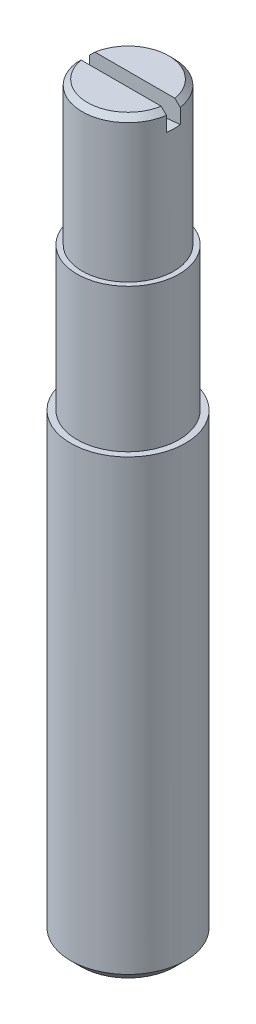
ISO-10303-21;
HEADER;
FILE_DESCRIPTION(('STEP AP214'),'2;1');
FILE_NAME('part.step','',(''),(''),'','','');
FILE_SCHEMA(('AUTOMOTIVE_DESIGN { 1 0 10303 214 1 1 1 1 }'));
ENDSEC;
DATA;
#1=APPLICATION_CONTEXT('core data for automotive mechanical design processes');
#2=APPLICATION_PROTOCOL_DEFINITION('international standard','automotive_design',2000,#1);
#3=PRODUCT_CONTEXT('',#1,'mechanical');
#4=PRODUCT('Part','Part','',(#3));
#5=PRODUCT_RELATED_PRODUCT_CATEGORY('part','',(#4));
#6=PRODUCT_DEFINITION_FORMATION('','',#4);
#7=PRODUCT_DEFINITION_CONTEXT('part definition',#1,'design');
#8=PRODUCT_DEFINITION('design','',#6,#7);
#9=PRODUCT_DEFINITION_SHAPE('','',#8);
#10=(LENGTH_UNIT() NAMED_UNIT(*) SI_UNIT(.MILLI.,.METRE.));
#11=(NAMED_UNIT(*) PLANE_ANGLE_UNIT() SI_UNIT($,.RADIAN.));
#12=(NAMED_UNIT(*) SI_UNIT($,.STERADIAN.) SOLID_ANGLE_UNIT());
#13=UNCERTAINTY_MEASURE_WITH_UNIT(LENGTH_MEASURE(1.E-05),#10,'distance_accuracy_value','');
#14=(GEOMETRIC_REPRESENTATION_CONTEXT(3) GLOBAL_UNCERTAINTY_ASSIGNED_CONTEXT((#13)) GLOBAL_UNIT_ASSIGNED_CONTEXT((#10,
#11,#12)) REPRESENTATION_CONTEXT('',''));
#15=CARTESIAN_POINT('',(0.,0.,0.));
#16=DIRECTION('',(0.,0.,1.));
#17=DIRECTION('',(1.,0.,0.));
#18=AXIS2_PLACEMENT_3D('',#15,#16,#17);
#19=CARTESIAN_POINT('',(0.,50.,0.));
#20=DIRECTION('',(0.,-1.,0.));
#21=DIRECTION('',(0.,0.,-1.));
#22=AXIS2_PLACEMENT_3D('',#19,#20,#21);
#23=PLANE('',#22);
#24=CARTESIAN_POINT('',(0.,50.0000000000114,0.));
#25=DIRECTION('',(0.,-1.,0.));
#26=DIRECTION('',(0.,0.,-1.));
#27=AXIS2_PLACEMENT_3D('',#24,#25,#26);
#28=CIRCLE('',#27,3.53999999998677);
#29=CARTESIAN_POINT('',(-3.48878202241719,50.0000000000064,-0.6));
#30=VERTEX_POINT('',#29);
#31=CARTESIAN_POINT('',(3.48878202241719,50.0000000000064,-0.6));
#32=VERTEX_POINT('',#31);
#33=EDGE_CURVE('E165',#30,#32,#28,.T.);
#34=ORIENTED_EDGE('',*,*,#33,.F.);
#35=DIRECTION('',(1.,0.,0.));
#36=VECTOR('',#35,1.);
#37=CARTESIAN_POINT('',(0.,50.,-0.6));
#38=LINE('',#37,#36);
#39=EDGE_CURVE('E163',#32,#30,#38,.F.);
#40=ORIENTED_EDGE('',*,*,#39,.F.);
#41=EDGE_LOOP('',(#34,#40));
#42=FACE_BOUND('',#41,.T.);
#43=ADVANCED_FACE('F14',(#42),#23,.F.);
#44=CARTESIAN_POINT('',(0.,50.,0.));
#45=DIRECTION('',(0.,-1.,0.));
#46=DIRECTION('',(0.,0.,-1.));
#47=AXIS2_PLACEMENT_3D('',#44,#45,#46);
#48=PLANE('',#47);
#49=DIRECTION('',(1.,0.,0.));
#50=VECTOR('',#49,1.);
#51=CARTESIAN_POINT('',(0.,50.,0.6));
#52=LINE('',#51,#50);
#53=CARTESIAN_POINT('',(-3.48878202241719,50.0000000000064,0.6));
#54=VERTEX_POINT('',#53);
#55=CARTESIAN_POINT('',(3.48878202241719,50.0000000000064,0.6));
#56=VERTEX_POINT('',#55);
#57=EDGE_CURVE('E161',#54,#56,#52,.T.);
#58=ORIENTED_EDGE('',*,*,#57,.F.);
#59=CARTESIAN_POINT('',(0.,50.0000000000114,0.));
#60=DIRECTION('',(0.,-1.,0.));
#61=DIRECTION('',(0.,0.,-1.));
#62=AXIS2_PLACEMENT_3D('',#59,#60,#61);
#63=CIRCLE('',#62,3.53999999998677);
#64=EDGE_CURVE('E159',#56,#54,#63,.T.);
#65=ORIENTED_EDGE('',*,*,#64,.F.);
#66=EDGE_LOOP('',(#58,#65));
#67=FACE_BOUND('',#66,.T.);
#68=ADVANCED_FACE('F121',(#67),#48,.F.);
#69=CARTESIAN_POINT('',(0.,49.5399999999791,0.));
#70=DIRECTION('',(0.,-1.,0.));
#71=DIRECTION('',(0.,0.,-1.));
#72=AXIS2_PLACEMENT_3D('',#69,#70,#71);
#73=CONICAL_SURFACE('',#72,3.99999999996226,0.785398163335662);
#74=CARTESIAN_POINT('',(-3.48878202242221,50.0000000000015,-0.6));
#75=CARTESIAN_POINT('',(-3.56650335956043,49.9233951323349,-0.6));
#76=CARTESIAN_POINT('',(-3.64419419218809,49.8467593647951,-0.6));
#77=CARTESIAN_POINT('',(-3.79951484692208,49.6934260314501,-0.6));
#78=CARTESIAN_POINT('',(-3.87714466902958,49.6167284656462,-0.6));
#79=CARTESIAN_POINT('',(-3.9547439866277,49.5399999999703,-0.6));
#80=B_SPLINE_CURVE_WITH_KNOTS('',3,(#74,#75,#76,#77,#78,#79),.UNSPECIFIED.,.F.,.F.,(4,2,4),(0.,
0.327383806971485,0.654767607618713),.UNSPECIFIED.);
#81=CARTESIAN_POINT('',(-3.95474398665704,49.5399999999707,-0.6));
#82=VERTEX_POINT('',#81);
#83=EDGE_CURVE('E39',#30,#82,#80,.T.);
#84=ORIENTED_EDGE('',*,*,#83,.F.);
#85=ORIENTED_EDGE('',*,*,#33,.T.);
#86=CARTESIAN_POINT('',(3.95474398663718,49.5399999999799,-0.600000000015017));
#87=CARTESIAN_POINT('',(3.87714466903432,49.616728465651,-0.600000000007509));
#88=CARTESIAN_POINT('',(3.79951484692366,49.6934260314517,-0.600000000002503));
#89=CARTESIAN_POINT('',(3.64419419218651,49.8467593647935,-0.599999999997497));
#90=CARTESIAN_POINT('',(3.56650335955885,49.9233951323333,-0.599999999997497));
#91=CARTESIAN_POINT('',(3.48878202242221,50.0000000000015,-0.6));
#92=B_SPLINE_CURVE_WITH_KNOTS('',3,(#86,#87,#88,#89,#90,#91),.UNSPECIFIED.,.F.,.F.,(4,2,4),(0.,
0.327383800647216,0.654767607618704),.UNSPECIFIED.);
#93=CARTESIAN_POINT('',(3.95474398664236,49.5399999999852,-0.6));
#94=VERTEX_POINT('',#93);
#95=EDGE_CURVE('E134',#94,#32,#92,.T.);
#96=ORIENTED_EDGE('',*,*,#95,.F.);
#97=CARTESIAN_POINT('',(0.,49.54,0.));
#98=DIRECTION('',(0.,-1.,0.));
#99=DIRECTION('',(0.,0.,-1.));
#100=AXIS2_PLACEMENT_3D('',#97,#98,#99);
#101=CIRCLE('',#100,4.);
#102=EDGE_CURVE('E175',#82,#94,#101,.T.);
#103=ORIENTED_EDGE('',*,*,#102,.F.);
#104=EDGE_LOOP('',(#84,#85,#96,#103));
#105=FACE_BOUND('',#104,.T.);
#106=ADVANCED_FACE('F116',(#105),#73,.T.);
#107=CARTESIAN_POINT('',(0.,79.5,-0.6));
#108=DIRECTION('',(0.,0.,1.));
#109=DIRECTION('',(1.,0.,0.));
#110=AXIS2_PLACEMENT_3D('',#107,#108,#109);
#111=PLANE('',#110);
#112=ORIENTED_EDGE('',*,*,#39,.T.);
#113=ORIENTED_EDGE('',*,*,#83,.T.);
#114=DIRECTION('',(0.,1.,0.));
#115=VECTOR('',#114,1.);
#116=CARTESIAN_POINT('',(-3.95474398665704,79.5,-0.6));
#117=LINE('',#116,#115);
#118=CARTESIAN_POINT('',(-3.95474398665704,48.2492400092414,-0.6));
#119=VERTEX_POINT('',#118);
#120=EDGE_CURVE('E154',#82,#119,#117,.F.);
#121=ORIENTED_EDGE('',*,*,#120,.T.);
#122=CARTESIAN_POINT('',(0.,79.5,-0.6));
#123=DIRECTION('',(0.,0.,-1.));
#124=DIRECTION('',(-1.,0.,0.));
#125=AXIS2_PLACEMENT_3D('',#122,#123,#124);
#126=CIRCLE('',#125,31.5);
#127=CARTESIAN_POINT('',(3.95474398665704,48.2492400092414,-0.6));
#128=VERTEX_POINT('',#127);
#129=EDGE_CURVE('E89',#119,#128,#126,.F.);
#130=ORIENTED_EDGE('',*,*,#129,.T.);
#131=DIRECTION('',(0.,1.,0.));
#132=VECTOR('',#131,1.);
#133=CARTESIAN_POINT('',(3.95474398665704,79.5,-0.6));
#134=LINE('',#133,#132);
#135=EDGE_CURVE('E140',#128,#94,#134,.T.);
#136=ORIENTED_EDGE('',*,*,#135,.T.);
#137=ORIENTED_EDGE('',*,*,#95,.T.);
#138=EDGE_LOOP('',(#112,#113,#121,#130,#136,#137));
#139=FACE_BOUND('',#138,.T.);
#140=ADVANCED_FACE('F120',(#139),#111,.T.);
#141=CARTESIAN_POINT('',(0.,49.5399999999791,0.));
#142=DIRECTION('',(0.,-1.,0.));
#143=DIRECTION('',(0.,0.,-1.));
#144=AXIS2_PLACEMENT_3D('',#141,#142,#143);
#145=CONICAL_SURFACE('',#144,3.99999999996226,0.785398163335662);
#146=ORIENTED_EDGE('',*,*,#64,.T.);
#147=CARTESIAN_POINT('',(-3.48878202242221,50.0000000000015,0.6));
#148=CARTESIAN_POINT('',(-3.56650335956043,49.9233951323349,0.6));
#149=CARTESIAN_POINT('',(-3.64419419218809,49.8467593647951,0.6));
#150=CARTESIAN_POINT('',(-3.79951484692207,49.6934260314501,0.6));
#151=CARTESIAN_POINT('',(-3.87714466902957,49.6167284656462,0.6));
#152=CARTESIAN_POINT('',(-3.95474398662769,49.5399999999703,0.6));
#153=B_SPLINE_CURVE_WITH_KNOTS('',3,(#147,#148,#149,#150,#151,#152),.UNSPECIFIED.,.F.,.F.,(4,2,
4),(0.,0.327383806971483,0.654767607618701),.UNSPECIFIED.);
#154=CARTESIAN_POINT('',(-3.95474398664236,49.5399999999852,0.6));
#155=VERTEX_POINT('',#154);
#156=EDGE_CURVE('E149',#54,#155,#153,.T.);
#157=ORIENTED_EDGE('',*,*,#156,.T.);
#158=CARTESIAN_POINT('',(0.,49.54,0.));
#159=DIRECTION('',(0.,-1.,0.));
#160=DIRECTION('',(0.,0.,-1.));
#161=AXIS2_PLACEMENT_3D('',#158,#159,#160);
#162=CIRCLE('',#161,4.);
#163=CARTESIAN_POINT('',(3.95474398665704,49.5399999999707,0.6));
#164=VERTEX_POINT('',#163);
#165=EDGE_CURVE('E79',#164,#155,#162,.T.);
#166=ORIENTED_EDGE('',*,*,#165,.F.);
#167=CARTESIAN_POINT('',(3.95474398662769,49.5399999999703,0.6));
#168=CARTESIAN_POINT('',(3.87714466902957,49.6167284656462,0.6));
#169=CARTESIAN_POINT('',(3.79951484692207,49.6934260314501,0.6));
#170=CARTESIAN_POINT('',(3.64419419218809,49.8467593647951,0.6));
#171=CARTESIAN_POINT('',(3.56650335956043,49.9233951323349,0.6));
#172=CARTESIAN_POINT('',(3.48878202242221,50.0000000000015,0.6));
#173=B_SPLINE_CURVE_WITH_KNOTS('',3,(#167,#168,#169,#170,#171,#172),.UNSPECIFIED.,.F.,.F.,(4,2,
4),(0.,0.327383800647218,0.654767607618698),.UNSPECIFIED.);
#174=EDGE_CURVE('E97',#164,#56,#173,.T.);
#175=ORIENTED_EDGE('',*,*,#174,.T.);
#176=EDGE_LOOP('',(#146,#157,#166,#175));
#177=FACE_BOUND('',#176,.T.);
#178=ADVANCED_FACE('F122',(#177),#145,.T.);
#179=CARTESIAN_POINT('',(0.,79.5,0.6));
#180=DIRECTION('',(0.,0.,1.));
#181=DIRECTION('',(1.,0.,0.));
#182=AXIS2_PLACEMENT_3D('',#179,#180,#181);
#183=PLANE('',#182);
#184=ORIENTED_EDGE('',*,*,#57,.T.);
#185=ORIENTED_EDGE('',*,*,#174,.F.);
#186=DIRECTION('',(0.,1.,0.));
#187=VECTOR('',#186,1.);
#188=CARTESIAN_POINT('',(3.95474398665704,79.5,0.6));
#189=LINE('',#188,#187);
#190=CARTESIAN_POINT('',(3.95474398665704,48.2492400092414,0.6));
#191=VERTEX_POINT('',#190);
#192=EDGE_CURVE('E95',#191,#164,#189,.T.);
#193=ORIENTED_EDGE('',*,*,#192,.F.);
#194=CARTESIAN_POINT('',(0.,79.5,0.6));
#195=DIRECTION('',(0.,0.,-1.));
#196=DIRECTION('',(-1.,0.,0.));
#197=AXIS2_PLACEMENT_3D('',#194,#195,#196);
#198=CIRCLE('',#197,31.5);
#199=CARTESIAN_POINT('',(-3.95474398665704,48.2492400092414,0.6));
#200=VERTEX_POINT('',#199);
#201=EDGE_CURVE('E82',#200,#191,#198,.F.);
#202=ORIENTED_EDGE('',*,*,#201,.F.);
#203=DIRECTION('',(0.,1.,0.));
#204=VECTOR('',#203,1.);
#205=CARTESIAN_POINT('',(-3.95474398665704,79.5,0.6));
#206=LINE('',#205,#204);
#207=EDGE_CURVE('E73',#155,#200,#206,.F.);
#208=ORIENTED_EDGE('',*,*,#207,.F.);
#209=ORIENTED_EDGE('',*,*,#156,.F.);
#210=EDGE_LOOP('',(#184,#185,#193,#202,#208,#209));
#211=FACE_BOUND('',#210,.T.);
#212=ADVANCED_FACE('F93',(#211),#183,.F.);
#213=CARTESIAN_POINT('',(0.,79.5,0.6));
#214=DIRECTION('',(0.,0.,-1.));
#215=DIRECTION('',(-1.,0.,0.));
#216=AXIS2_PLACEMENT_3D('',#213,#214,#215);
#217=CYLINDRICAL_SURFACE('',#216,31.5);
#218=CARTESIAN_POINT('',(3.95474398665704,48.2492400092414,-0.6));
#219=CARTESIAN_POINT('',(3.96984984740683,48.2511544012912,-0.500484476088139));
#220=CARTESIAN_POINT('',(3.98118553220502,48.2525972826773,-0.40038868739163));
#221=CARTESIAN_POINT('',(3.9962389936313,48.2545175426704,-0.20019306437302));
#222=CARTESIAN_POINT('',(4.,48.2550004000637,-0.10009653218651));
#223=CARTESIAN_POINT('',(4.,48.2550004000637,0.10009653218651));
#224=CARTESIAN_POINT('',(3.9962389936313,48.2545175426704,0.20019306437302));
#225=CARTESIAN_POINT('',(3.98118553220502,48.2525972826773,0.40038868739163));
#226=CARTESIAN_POINT('',(3.96984984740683,48.2511544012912,0.500484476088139));
#227=CARTESIAN_POINT('',(3.95474398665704,48.2492400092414,0.6));
#228=B_SPLINE_CURVE_WITH_KNOTS('',3,(#218,#219,#220,#221,#222,#223,#224,#225,#226,#227),
.UNSPECIFIED.,.F.,.F.,(4,2,2,2,4),(0.,0.301946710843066,0.602165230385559,0.902383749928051,
1.20433046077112),.UNSPECIFIED.);
#229=EDGE_CURVE('E83',#128,#191,#228,.T.);
#230=ORIENTED_EDGE('',*,*,#229,.F.);
#231=ORIENTED_EDGE('',*,*,#129,.F.);
#232=CARTESIAN_POINT('',(-3.95474398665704,48.2492400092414,0.6));
#233=CARTESIAN_POINT('',(-3.96984984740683,48.2511544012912,0.500484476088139));
#234=CARTESIAN_POINT('',(-3.98118553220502,48.2525972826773,0.40038868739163));
#235=CARTESIAN_POINT('',(-3.9962389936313,48.2545175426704,0.20019306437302));
#236=CARTESIAN_POINT('',(-4.,48.2550004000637,0.10009653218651));
#237=CARTESIAN_POINT('',(-4.,48.2550004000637,-0.10009653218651));
#238=CARTESIAN_POINT('',(-3.9962389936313,48.2545175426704,-0.20019306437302));
#239=CARTESIAN_POINT('',(-3.98118553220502,48.2525972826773,-0.40038868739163));
#240=CARTESIAN_POINT('',(-3.96984984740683,48.2511544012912,-0.500484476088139));
#241=CARTESIAN_POINT('',(-3.95474398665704,48.2492400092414,-0.6));
#242=B_SPLINE_CURVE_WITH_KNOTS('',3,(#232,#233,#234,#235,#236,#237,#238,#239,#240,#241),
.UNSPECIFIED.,.F.,.F.,(4,2,2,2,4),(0.,0.301946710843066,0.602165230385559,0.902383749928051,
1.20433046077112),.UNSPECIFIED.);
#243=EDGE_CURVE('E19',#200,#119,#242,.T.);
#244=ORIENTED_EDGE('',*,*,#243,.F.);
#245=ORIENTED_EDGE('',*,*,#201,.T.);
#246=EDGE_LOOP('',(#230,#231,#244,#245));
#247=FACE_BOUND('',#246,.T.);
#248=ADVANCED_FACE('F16',(#247),#217,.F.);
#249=CARTESIAN_POINT('',(0.,37.5,0.));
#250=DIRECTION('',(0.,-1.,0.));
#251=DIRECTION('',(0.,0.,-1.));
#252=AXIS2_PLACEMENT_3D('',#249,#250,#251);
#253=CYLINDRICAL_SURFACE('',#252,4.);
#254=ORIENTED_EDGE('',*,*,#229,.T.);
#255=ORIENTED_EDGE('',*,*,#192,.T.);
#256=ORIENTED_EDGE('',*,*,#165,.T.);
#257=ORIENTED_EDGE('',*,*,#207,.T.);
#258=ORIENTED_EDGE('',*,*,#243,.T.);
#259=ORIENTED_EDGE('',*,*,#120,.F.);
#260=ORIENTED_EDGE('',*,*,#102,.T.);
#261=ORIENTED_EDGE('',*,*,#135,.F.);
#262=EDGE_LOOP('',(#254,#255,#256,#257,#258,#259,#260,#261));
#263=FACE_BOUND('',#262,.T.);
#264=CARTESIAN_POINT('',(0.,37.5,0.));
#265=DIRECTION('',(0.,-1.,0.));
#266=DIRECTION('',(0.,0.,-1.));
#267=AXIS2_PLACEMENT_3D('',#264,#265,#266);
#268=CIRCLE('',#267,4.);
#269=CARTESIAN_POINT('',(0.,37.5,-4.));
#270=VERTEX_POINT('',#269);
#271=EDGE_CURVE('E171',#270,#270,#268,.F.);
#272=ORIENTED_EDGE('',*,*,#271,.T.);
#273=EDGE_LOOP('',(#272));
#274=FACE_BOUND('',#273,.T.);
#275=ADVANCED_FACE('F75',(#263,#274),#253,.T.);
#276=CARTESIAN_POINT('',(0.,37.5,0.));
#277=DIRECTION('',(0.,-1.,0.));
#278=DIRECTION('',(0.,0.,-1.));
#279=AXIS2_PLACEMENT_3D('',#276,#277,#278);
#280=PLANE('',#279);
#281=ORIENTED_EDGE('',*,*,#271,.F.);
#282=EDGE_LOOP('',(#281));
#283=FACE_BOUND('',#282,.T.);
#284=CARTESIAN_POINT('',(0.,37.5,0.));
#285=DIRECTION('',(0.,-1.,0.));
#286=DIRECTION('',(0.,0.,-1.));
#287=AXIS2_PLACEMENT_3D('',#284,#285,#286);
#288=CIRCLE('',#287,4.45);
#289=CARTESIAN_POINT('',(0.,37.5,-4.45));
#290=VERTEX_POINT('',#289);
#291=EDGE_CURVE('E174',#290,#290,#288,.T.);
#292=ORIENTED_EDGE('',*,*,#291,.F.);
#293=EDGE_LOOP('',(#292));
#294=FACE_BOUND('',#293,.T.);
#295=ADVANCED_FACE('F114',(#283,#294),#280,.F.);
#296=CARTESIAN_POINT('',(0.,25.,0.));
#297=DIRECTION('',(0.,-1.,0.));
#298=DIRECTION('',(0.,0.,-1.));
#299=AXIS2_PLACEMENT_3D('',#296,#297,#298);
#300=CYLINDRICAL_SURFACE('',#299,4.45);
#301=ORIENTED_EDGE('',*,*,#291,.T.);
#302=EDGE_LOOP('',(#301));
#303=FACE_BOUND('',#302,.T.);
#304=CARTESIAN_POINT('',(0.,25.,0.));
#305=DIRECTION('',(0.,-1.,0.));
#306=DIRECTION('',(0.,0.,-1.));
#307=AXIS2_PLACEMENT_3D('',#304,#305,#306);
#308=CIRCLE('',#307,4.45);
#309=CARTESIAN_POINT('',(0.,25.,-4.45));
#310=VERTEX_POINT('',#309);
#311=EDGE_CURVE('E30',#310,#310,#308,.F.);
#312=ORIENTED_EDGE('',*,*,#311,.T.);
#313=EDGE_LOOP('',(#312));
#314=FACE_BOUND('',#313,.T.);
#315=ADVANCED_FACE('F218',(#303,#314),#300,.T.);
#316=CARTESIAN_POINT('',(0.,25.,0.));
#317=DIRECTION('',(0.,-1.,0.));
#318=DIRECTION('',(0.,0.,-1.));
#319=AXIS2_PLACEMENT_3D('',#316,#317,#318);
#320=PLANE('',#319);
#321=ORIENTED_EDGE('',*,*,#311,.F.);
#322=EDGE_LOOP('',(#321));
#323=FACE_BOUND('',#322,.T.);
#324=CARTESIAN_POINT('',(0.,25.,0.));
#325=DIRECTION('',(0.,-1.,0.));
#326=DIRECTION('',(0.,0.,-1.));
#327=AXIS2_PLACEMENT_3D('',#324,#325,#326);
#328=CIRCLE('',#327,5.);
#329=CARTESIAN_POINT('',(0.,25.,-5.));
#330=VERTEX_POINT('',#329);
#331=EDGE_CURVE('E9',#330,#330,#328,.T.);
#332=ORIENTED_EDGE('',*,*,#331,.F.);
#333=EDGE_LOOP('',(#332));
#334=FACE_BOUND('',#333,.T.);
#335=ADVANCED_FACE('F213',(#323,#334),#320,.F.);
#336=CARTESIAN_POINT('',(0.,0.,0.));
#337=DIRECTION('',(0.,-1.,0.));
#338=DIRECTION('',(0.,0.,-1.));
#339=AXIS2_PLACEMENT_3D('',#336,#337,#338);
#340=CYLINDRICAL_SURFACE('',#339,5.);
#341=ORIENTED_EDGE('',*,*,#331,.T.);
#342=EDGE_LOOP('',(#341));
#343=FACE_BOUND('',#342,.T.);
#344=CARTESIAN_POINT('',(0.,-14.08,0.));
#345=DIRECTION('',(0.,-1.,0.));
#346=DIRECTION('',(0.,0.,-1.));
#347=AXIS2_PLACEMENT_3D('',#344,#345,#346);
#348=CIRCLE('',#347,5.);
#349=CARTESIAN_POINT('',(0.,-14.08,-5.));
#350=VERTEX_POINT('',#349);
#351=EDGE_CURVE('E191',#350,#350,#348,.F.);
#352=ORIENTED_EDGE('',*,*,#351,.T.);
#353=EDGE_LOOP('',(#352));
#354=FACE_BOUND('',#353,.T.);
#355=ADVANCED_FACE('F203',(#343,#354),#340,.T.);
#356=CARTESIAN_POINT('',(4.08,-15.,0.));
#357=DIRECTION('',(0.,1.,0.));
#358=DIRECTION('',(0.,0.,1.));
#359=AXIS2_PLACEMENT_3D('',#356,#357,#358);
#360=PLANE('',#359);
#361=CARTESIAN_POINT('',(0.,-14.9999999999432,0.));
#362=DIRECTION('',(0.,1.,0.));
#363=DIRECTION('',(0.,0.,1.));
#364=AXIS2_PLACEMENT_3D('',#361,#362,#363);
#365=CIRCLE('',#364,4.07999999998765);
#366=CARTESIAN_POINT('',(0.,-14.9999999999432,4.07999999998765));
#367=VERTEX_POINT('',#366);
#368=EDGE_CURVE('E91',#367,#367,#365,.T.);
#369=ORIENTED_EDGE('',*,*,#368,.F.);
#370=EDGE_LOOP('',(#369));
#371=FACE_BOUND('',#370,.T.);
#372=ADVANCED_FACE('F201',(#371),#360,.F.);
#373=CARTESIAN_POINT('',(0.,-14.0799999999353,0.));
#374=DIRECTION('',(0.,1.,0.));
#375=DIRECTION('',(0.,0.,1.));
#376=AXIS2_PLACEMENT_3D('',#373,#374,#375);
#377=CONICAL_SURFACE('',#376,4.99999999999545,0.785398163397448);
#378=ORIENTED_EDGE('',*,*,#351,.F.);
#379=EDGE_LOOP('',(#378));
#380=FACE_BOUND('',#379,.T.);
#381=ORIENTED_EDGE('',*,*,#368,.T.);
#382=EDGE_LOOP('',(#381));
#383=FACE_BOUND('',#382,.T.);
#384=ADVANCED_FACE('F199',(#380,#383),#377,.T.);
#385=CLOSED_SHELL('',(#43,#68,#106,#140,#178,#212,#248,#275,#295,#315,#335,#355,#372,#384));
#386=MANIFOLD_SOLID_BREP('B1',#385);
#387=ADVANCED_BREP_SHAPE_REPRESENTATION('',(#18,#386),#14);
#388=SHAPE_DEFINITION_REPRESENTATION(#9,#387);
ENDSEC;
END-ISO-10303-21;
